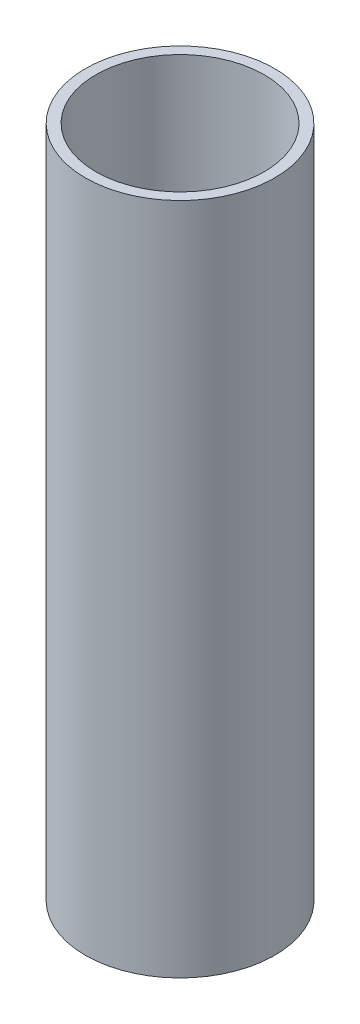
ISO-10303-21;
HEADER;
FILE_DESCRIPTION(('STEP AP214'),'2;1');
FILE_NAME('part.step','',(''),(''),'','','');
FILE_SCHEMA(('AUTOMOTIVE_DESIGN { 1 0 10303 214 1 1 1 1 }'));
ENDSEC;
DATA;
#1=APPLICATION_CONTEXT('core data for automotive mechanical design processes');
#2=APPLICATION_PROTOCOL_DEFINITION('international standard','automotive_design',2000,#1);
#3=PRODUCT_CONTEXT('',#1,'mechanical');
#4=PRODUCT('Part','Part','',(#3));
#5=PRODUCT_RELATED_PRODUCT_CATEGORY('part','',(#4));
#6=PRODUCT_DEFINITION_FORMATION('','',#4);
#7=PRODUCT_DEFINITION_CONTEXT('part definition',#1,'design');
#8=PRODUCT_DEFINITION('design','',#6,#7);
#9=PRODUCT_DEFINITION_SHAPE('','',#8);
#10=(LENGTH_UNIT() NAMED_UNIT(*) SI_UNIT(.MILLI.,.METRE.));
#11=(NAMED_UNIT(*) PLANE_ANGLE_UNIT() SI_UNIT($,.RADIAN.));
#12=(NAMED_UNIT(*) SI_UNIT($,.STERADIAN.) SOLID_ANGLE_UNIT());
#13=UNCERTAINTY_MEASURE_WITH_UNIT(LENGTH_MEASURE(1.E-05),#10,'distance_accuracy_value','');
#14=(GEOMETRIC_REPRESENTATION_CONTEXT(3) GLOBAL_UNCERTAINTY_ASSIGNED_CONTEXT((#13)) GLOBAL_UNIT_ASSIGNED_CONTEXT((#10,
#11,#12)) REPRESENTATION_CONTEXT('',''));
#15=CARTESIAN_POINT('',(0.,0.,0.));
#16=DIRECTION('',(0.,0.,1.));
#17=DIRECTION('',(1.,0.,0.));
#18=AXIS2_PLACEMENT_3D('',#15,#16,#17);
#19=CARTESIAN_POINT('',(0.,50.8,0.));
#20=DIRECTION('',(0.,1.,0.));
#21=DIRECTION('',(0.,0.,1.));
#22=AXIS2_PLACEMENT_3D('',#19,#20,#21);
#23=PLANE('',#22);
#24=CARTESIAN_POINT('',(0.,50.8,0.));
#25=DIRECTION('',(0.,1.,0.));
#26=DIRECTION('',(0.,0.,1.));
#27=AXIS2_PLACEMENT_3D('',#24,#25,#26);
#28=CIRCLE('',#27,7.14375);
#29=CARTESIAN_POINT('',(0.,50.8,7.14375));
#30=VERTEX_POINT('',#29);
#31=EDGE_CURVE('E10',#30,#30,#28,.T.);
#32=ORIENTED_EDGE('',*,*,#31,.T.);
#33=EDGE_LOOP('',(#32));
#34=FACE_BOUND('',#33,.T.);
#35=CARTESIAN_POINT('',(0.,50.8,0.));
#36=DIRECTION('',(0.,1.,0.));
#37=DIRECTION('',(0.,0.,1.));
#38=AXIS2_PLACEMENT_3D('',#35,#36,#37);
#39=CIRCLE('',#38,6.35);
#40=CARTESIAN_POINT('',(0.,50.8,6.35));
#41=VERTEX_POINT('',#40);
#42=EDGE_CURVE('E43',#41,#41,#39,.T.);
#43=ORIENTED_EDGE('',*,*,#42,.F.);
#44=EDGE_LOOP('',(#43));
#45=FACE_BOUND('',#44,.T.);
#46=ADVANCED_FACE('F32',(#34,#45),#23,.T.);
#47=CARTESIAN_POINT('',(0.,0.,0.));
#48=DIRECTION('',(0.,1.,0.));
#49=DIRECTION('',(0.,0.,1.));
#50=AXIS2_PLACEMENT_3D('',#47,#48,#49);
#51=PLANE('',#50);
#52=CARTESIAN_POINT('',(0.,0.,0.));
#53=DIRECTION('',(0.,1.,0.));
#54=DIRECTION('',(0.,0.,1.));
#55=AXIS2_PLACEMENT_3D('',#52,#53,#54);
#56=CIRCLE('',#55,7.14375);
#57=CARTESIAN_POINT('',(0.,0.,7.14375));
#58=VERTEX_POINT('',#57);
#59=EDGE_CURVE('E36',#58,#58,#56,.T.);
#60=ORIENTED_EDGE('',*,*,#59,.F.);
#61=EDGE_LOOP('',(#60));
#62=FACE_BOUND('',#61,.T.);
#63=CARTESIAN_POINT('',(0.,0.,0.));
#64=DIRECTION('',(0.,1.,0.));
#65=DIRECTION('',(0.,0.,1.));
#66=AXIS2_PLACEMENT_3D('',#63,#64,#65);
#67=CIRCLE('',#66,6.35);
#68=CARTESIAN_POINT('',(0.,0.,6.35));
#69=VERTEX_POINT('',#68);
#70=EDGE_CURVE('E45',#69,#69,#67,.T.);
#71=ORIENTED_EDGE('',*,*,#70,.T.);
#72=EDGE_LOOP('',(#71));
#73=FACE_BOUND('',#72,.T.);
#74=ADVANCED_FACE('F55',(#62,#73),#51,.F.);
#75=CARTESIAN_POINT('',(0.,50.8,0.));
#76=DIRECTION('',(0.,-1.,0.));
#77=DIRECTION('',(0.,0.,-1.));
#78=AXIS2_PLACEMENT_3D('',#75,#76,#77);
#79=CYLINDRICAL_SURFACE('',#78,7.14375);
#80=ORIENTED_EDGE('',*,*,#31,.F.);
#81=EDGE_LOOP('',(#80));
#82=FACE_BOUND('',#81,.T.);
#83=ORIENTED_EDGE('',*,*,#59,.T.);
#84=EDGE_LOOP('',(#83));
#85=FACE_BOUND('',#84,.T.);
#86=ADVANCED_FACE('F34',(#82,#85),#79,.T.);
#87=CARTESIAN_POINT('',(0.,50.8,0.));
#88=DIRECTION('',(0.,-1.,0.));
#89=DIRECTION('',(0.,0.,-1.));
#90=AXIS2_PLACEMENT_3D('',#87,#88,#89);
#91=CYLINDRICAL_SURFACE('',#90,6.35);
#92=ORIENTED_EDGE('',*,*,#42,.T.);
#93=EDGE_LOOP('',(#92));
#94=FACE_BOUND('',#93,.T.);
#95=ORIENTED_EDGE('',*,*,#70,.F.);
#96=EDGE_LOOP('',(#95));
#97=FACE_BOUND('',#96,.T.);
#98=ADVANCED_FACE('F51',(#94,#97),#91,.F.);
#99=CLOSED_SHELL('',(#46,#74,#86,#98));
#100=MANIFOLD_SOLID_BREP('B2',#99);
#101=ADVANCED_BREP_SHAPE_REPRESENTATION('',(#18,#100),#14);
#102=SHAPE_DEFINITION_REPRESENTATION(#9,#101);
ENDSEC;
END-ISO-10303-21;
